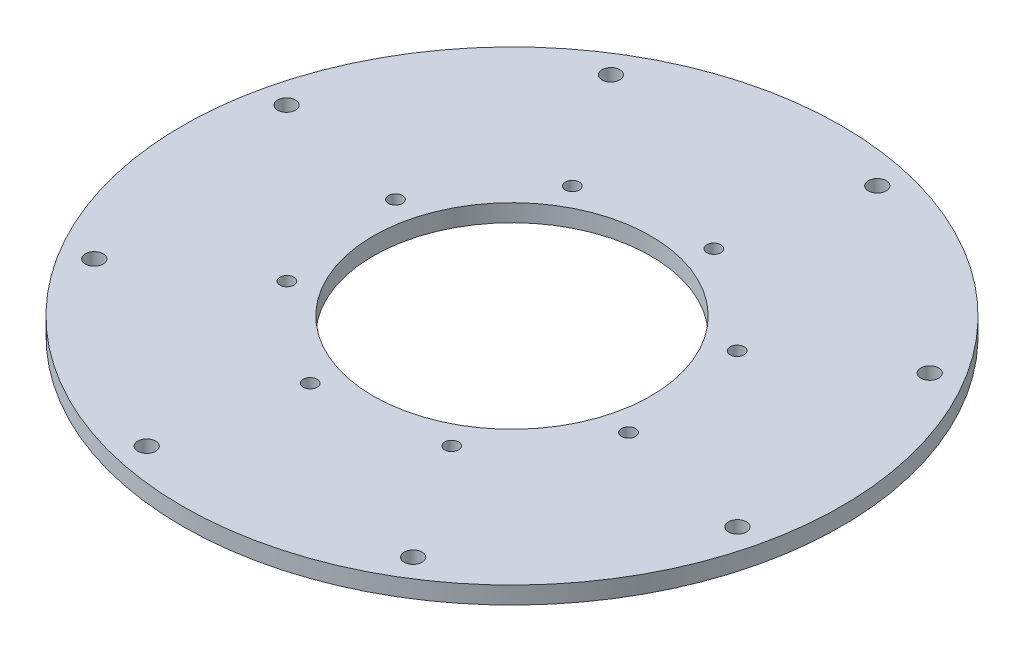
from build123d import *

# Parameters (mm, degrees)
SKETCH1_R                             = 120.65
BOSS_EXTRUDE1_DEPTH                   = 6.35
SKETCH2_R                             = 50.8
CUT_EXTRUDE1_DEPTH                    = 171.742986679
F_0_257_DIAMETER_HOLE1_D              = 6.5278
F_0_257_DIAMETER_HOLE1_DEPTH          = 17.272
F_0_257_DIAMETER_HOLE1_TIP            = 1.961148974
TAPPED_HOLE_FOR_10_32_HELICOIL1_D     = 5.1054
TAPPED_HOLE_FOR_10_32_HELICOIL1_DEPTH = 11.938
TAPPED_HOLE_FOR_10_32_HELICOIL1_TIP   = 1.533816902


with BuildPart() as part:
    # Sketch1 → Boss-Extrude1 (new body)
    with BuildSketch(Plane(origin=(0, 0, 0), x_dir=(1, 0, 0), z_dir=(0, 1, 0))):
        with Locations(Location((0, 0, 0), (0, 0, 270))):
            Circle(SKETCH1_R)
    extrude(amount=BOSS_EXTRUDE1_DEPTH)

    # Sketch2 → Cut-Extrude1 (cut, through all)
    with BuildSketch(Plane(origin=(0, 6.35, 0), x_dir=(1, 0, 0), z_dir=(0, 1, 0))):
        with Locations(Location((0, 0, 0), (0, 0, 270))):
            Circle(SKETCH2_R)
    extrude(amount=-CUT_EXTRUDE1_DEPTH, mode=Mode.SUBTRACT)

    # F _0.257_ Diameter Hole1
    with Locations(Plane(origin=(0, 6.35, 0), x_dir=(1, 0, 0), z_dir=(0, 1, 0))):
        with Locations((25.590228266, 108.138364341), (94.560394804, 58.370346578), (-58.370346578, 94.560394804), (108.138364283, -25.590228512), (58.370346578, -94.560394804), (-25.590228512, -108.138364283), (-94.560394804, -58.370346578), (-108.138364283, 25.590228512)):
            Hole(F_0_257_DIAMETER_HOLE1_D / 2, depth=F_0_257_DIAMETER_HOLE1_DEPTH)
            with Locations((0, 0, -(F_0_257_DIAMETER_HOLE1_DEPTH + F_0_257_DIAMETER_HOLE1_TIP / 2))):  # 118° drill point
                Cone(0, F_0_257_DIAMETER_HOLE1_D / 2, F_0_257_DIAMETER_HOLE1_TIP, mode=Mode.SUBTRACT)

    # Tapped Hole for _10-32 Helicoil1
    with Locations(Plane(origin=(0, 0, 0), x_dir=(-1, 0, 0), z_dir=(0, -1, 0))):
        with Locations((52.244804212, -30.159344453), (58.268532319, 15.616778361), (30.159344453, 52.244804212), (-15.616778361, 58.268532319), (-52.244804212, 30.159344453), (-58.268532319, -15.616778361), (-30.159344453, -52.244804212), (15.616778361, -58.268532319)):
            Hole(TAPPED_HOLE_FOR_10_32_HELICOIL1_D / 2, depth=TAPPED_HOLE_FOR_10_32_HELICOIL1_DEPTH)
            with Locations((0, 0, -(TAPPED_HOLE_FOR_10_32_HELICOIL1_DEPTH + TAPPED_HOLE_FOR_10_32_HELICOIL1_TIP / 2))):  # 118° drill point
                Cone(0, TAPPED_HOLE_FOR_10_32_HELICOIL1_D / 2, TAPPED_HOLE_FOR_10_32_HELICOIL1_TIP, mode=Mode.SUBTRACT)


solid = part.part
